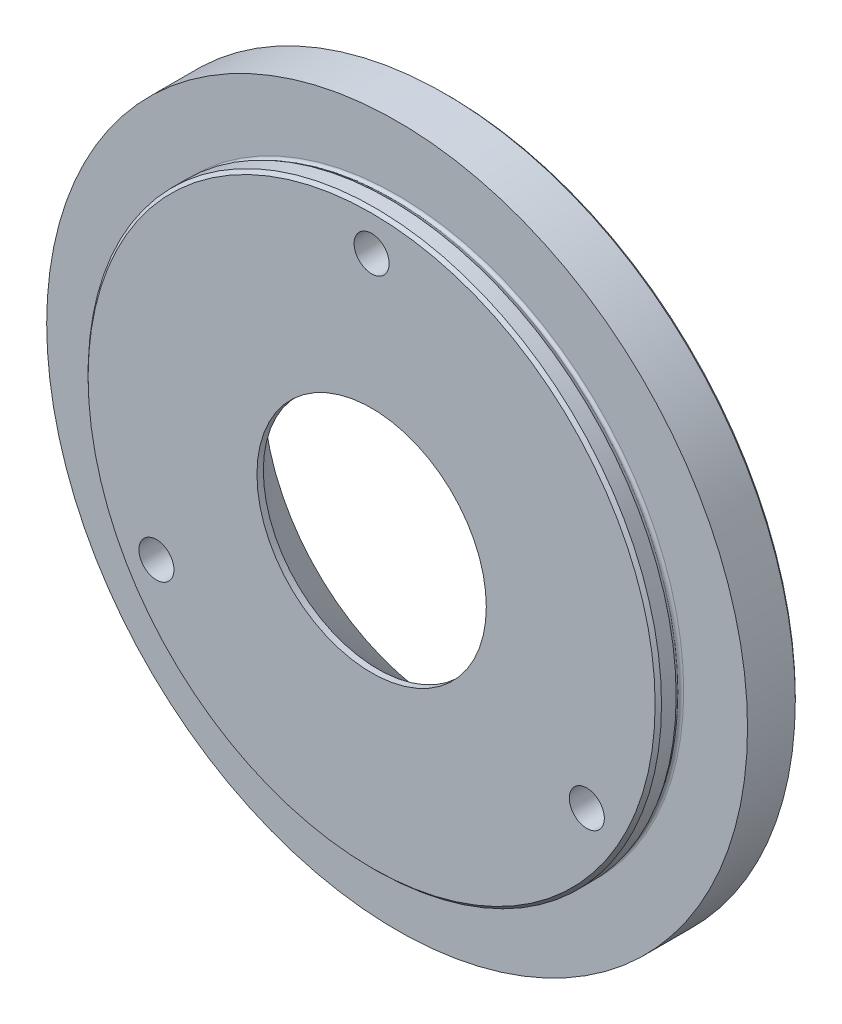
from build123d import *

# Parameters (mm, degrees)
CBORE_FOR_M5_HEX_SOCKET_HEAD_CAP_SCREW1_D           = 5.5
CBORE_FOR_M5_HEX_SOCKET_HEAD_CAP_SCREW1_CBORE_D     = 10
CBORE_FOR_M5_HEX_SOCKET_HEAD_CAP_SCREW1_CBORE_DEPTH = 5.7


with BuildPart() as part:
    # Sketch1 → Revolve1 (revolve)
    with BuildSketch(Plane(origin=(0, -18, -1.35), x_dir=(0, 0, -1), z_dir=(1, 0, 0)), mode=Mode.PRIVATE) as revolve1_sk:
        Polygon((-5.35, 36), (-4.35, 36), (6.65, 47), (6.65, 63), (-4.85, 63), (-5.35, 62.5), align=None)
    revolve(revolve1_sk.sketch.rotate(Axis((0, 0, 4), (0, 0, -1)), 90), axis=Axis((0, 0, 4), (0, 0, -1)))

    # Sketch2 → Revolve2 (revolve)
    with BuildSketch(Plane(origin=(0, 0, 0), x_dir=(0, 0, -1), z_dir=(1, 0, 0)), mode=Mode.PRIVATE) as revolve2_sk:
        Polygon((7.5, 55), (8, 54.5), (8, 45), (0, 45), (0, 55), align=None)
    revolve(revolve2_sk.sketch.rotate(Axis((0, 0, 4), (0, 0, -1)), 90), axis=Axis((0, 0, 4), (0, 0, -1)))

    # Sketch3 → Cut-Revolve1 (revolve, cut)
    with BuildSketch(Plane(origin=(0, 0, 0), x_dir=(0, 0, -1), z_dir=(1, 0, 0)), mode=Mode.PRIVATE) as cut_revolve1_sk:
        with BuildLine():
            Line((-1.2, 45), (0, 45))
            Line((0, 45), (0, 44.985964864))
            ThreePointArc((0, 44.985964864), (-0.203030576, 44.637822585), (-0.60601523, 44.643097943))
            Line((-0.60601523, 44.643097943), (-1.2, 45))
        make_face()
    revolve(cut_revolve1_sk.sketch.rotate(Axis((0, 0, 4), (0, 0, -1)), 90), axis=Axis((0, 0, 4), (0, 0, -1)), mode=Mode.SUBTRACT)

    # CBORE for M5 Hex Socket Head Cap Screw1 (through all)
    with Locations(Plane(origin=(0, 0, -8), x_dir=(-1, 0, 0), z_dir=(0, 0, -1))):
        with Locations((0, 39), (33.774990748, -19.5), (-33.774990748, -19.5)):
            CounterBoreHole(CBORE_FOR_M5_HEX_SOCKET_HEAD_CAP_SCREW1_D / 2, CBORE_FOR_M5_HEX_SOCKET_HEAD_CAP_SCREW1_CBORE_D / 2, CBORE_FOR_M5_HEX_SOCKET_HEAD_CAP_SCREW1_CBORE_DEPTH)


solid = part.part
